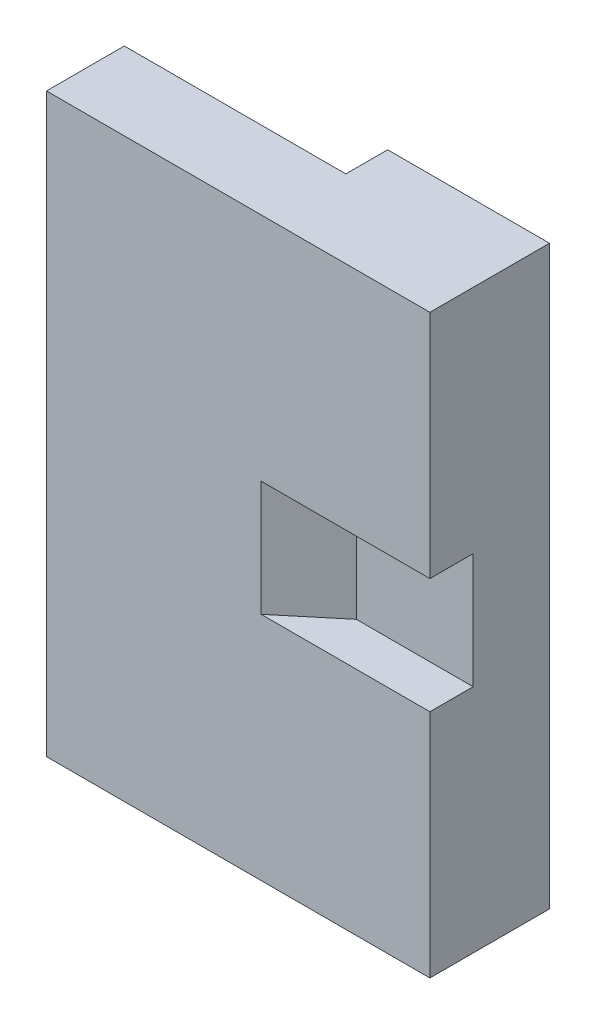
ISO-10303-21;
HEADER;
FILE_DESCRIPTION(('STEP AP214'),'2;1');
FILE_NAME('part.step','',(''),(''),'','','');
FILE_SCHEMA(('AUTOMOTIVE_DESIGN { 1 0 10303 214 1 1 1 1 }'));
ENDSEC;
DATA;
#1=APPLICATION_CONTEXT('core data for automotive mechanical design processes');
#2=APPLICATION_PROTOCOL_DEFINITION('international standard','automotive_design',2000,#1);
#3=PRODUCT_CONTEXT('',#1,'mechanical');
#4=PRODUCT('Part','Part','',(#3));
#5=PRODUCT_RELATED_PRODUCT_CATEGORY('part','',(#4));
#6=PRODUCT_DEFINITION_FORMATION('','',#4);
#7=PRODUCT_DEFINITION_CONTEXT('part definition',#1,'design');
#8=PRODUCT_DEFINITION('design','',#6,#7);
#9=PRODUCT_DEFINITION_SHAPE('','',#8);
#10=(LENGTH_UNIT() NAMED_UNIT(*) SI_UNIT(.MILLI.,.METRE.));
#11=(NAMED_UNIT(*) PLANE_ANGLE_UNIT() SI_UNIT($,.RADIAN.));
#12=(NAMED_UNIT(*) SI_UNIT($,.STERADIAN.) SOLID_ANGLE_UNIT());
#13=UNCERTAINTY_MEASURE_WITH_UNIT(LENGTH_MEASURE(1.E-05),#10,'distance_accuracy_value','');
#14=(GEOMETRIC_REPRESENTATION_CONTEXT(3) GLOBAL_UNCERTAINTY_ASSIGNED_CONTEXT((#13)) GLOBAL_UNIT_ASSIGNED_CONTEXT((#10,
#11,#12)) REPRESENTATION_CONTEXT('',''));
#15=CARTESIAN_POINT('',(0.,0.,0.));
#16=DIRECTION('',(0.,0.,1.));
#17=DIRECTION('',(1.,0.,0.));
#18=AXIS2_PLACEMENT_3D('',#15,#16,#17);
#19=CARTESIAN_POINT('',(768.53962280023,1228.445791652,820.));
#20=DIRECTION('',(-1.,0.,0.));
#21=DIRECTION('',(0.,0.,1.));
#22=AXIS2_PLACEMENT_3D('',#19,#20,#21);
#23=PLANE('',#22);
#24=DIRECTION('',(0.,-1.,0.));
#25=VECTOR('',#24,1.);
#26=CARTESIAN_POINT('',(768.53962280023,1000.,695.));
#27=LINE('',#26,#25);
#28=CARTESIAN_POINT('',(768.53962280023,1000.,695.));
#29=VERTEX_POINT('',#28);
#30=CARTESIAN_POINT('',(768.53962280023,580.00000000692,695.));
#31=VERTEX_POINT('',#30);
#32=EDGE_CURVE('E65',#29,#31,#27,.T.);
#33=ORIENTED_EDGE('',*,*,#32,.F.);
#34=DIRECTION('',(0.,0.,1.));
#35=VECTOR('',#34,1.);
#36=CARTESIAN_POINT('',(768.53962280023,1000.,0.));
#37=LINE('',#36,#35);
#38=CARTESIAN_POINT('',(768.53962280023,1000.,550.));
#39=VERTEX_POINT('',#38);
#40=EDGE_CURVE('E172',#39,#29,#37,.T.);
#41=ORIENTED_EDGE('',*,*,#40,.F.);
#42=DIRECTION('',(0.,1.,0.));
#43=VECTOR('',#42,1.);
#44=CARTESIAN_POINT('',(768.53962280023,-1.32374E-12,550.));
#45=LINE('',#44,#43);
#46=CARTESIAN_POINT('',(768.53962280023,580.00000000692,550.));
#47=VERTEX_POINT('',#46);
#48=EDGE_CURVE('E167',#47,#39,#45,.T.);
#49=ORIENTED_EDGE('',*,*,#48,.F.);
#50=DIRECTION('',(0.,0.,1.));
#51=VECTOR('',#50,1.);
#52=CARTESIAN_POINT('',(768.53962280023,580.00000000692,820.));
#53=LINE('',#52,#51);
#54=EDGE_CURVE('E11',#47,#31,#53,.T.);
#55=ORIENTED_EDGE('',*,*,#54,.T.);
#56=EDGE_LOOP('',(#33,#41,#49,#55));
#57=FACE_BOUND('',#56,.T.);
#58=ADVANCED_FACE('F46',(#57),#23,.T.);
#59=CARTESIAN_POINT('',(1330.,-100.,2.2737E-13));
#60=DIRECTION('',(1.,0.,0.));
#61=DIRECTION('',(0.,1.,0.));
#62=AXIS2_PLACEMENT_3D('',#59,#60,#61);
#63=PLANE('',#62);
#64=DIRECTION('',(0.,-1.,0.));
#65=VECTOR('',#64,1.);
#66=CARTESIAN_POINT('',(1330.,-1.90947E-12,815.));
#67=LINE('',#66,#65);
#68=CARTESIAN_POINT('',(1330.,200.,815.));
#69=VERTEX_POINT('',#68);
#70=CARTESIAN_POINT('',(1330.,-200.,815.));
#71=VERTEX_POINT('',#70);
#72=EDGE_CURVE('E194',#69,#71,#67,.T.);
#73=ORIENTED_EDGE('',*,*,#72,.T.);
#74=DIRECTION('',(0.,0.,-1.));
#75=VECTOR('',#74,1.);
#76=CARTESIAN_POINT('',(1330.,-200.,494.77399051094));
#77=LINE('',#76,#75);
#78=CARTESIAN_POINT('',(1330.,-200.,965.));
#79=VERTEX_POINT('',#78);
#80=EDGE_CURVE('E266',#79,#71,#77,.T.);
#81=ORIENTED_EDGE('',*,*,#80,.F.);
#82=DIRECTION('',(0.,1.,0.));
#83=VECTOR('',#82,1.);
#84=CARTESIAN_POINT('',(1330.,100.,965.));
#85=LINE('',#84,#83);
#86=CARTESIAN_POINT('',(1330.,-1000.,965.));
#87=VERTEX_POINT('',#86);
#88=EDGE_CURVE('E273',#87,#79,#85,.T.);
#89=ORIENTED_EDGE('',*,*,#88,.F.);
#90=DIRECTION('',(0.,0.,-1.));
#91=VECTOR('',#90,1.);
#92=CARTESIAN_POINT('',(1330.,-1000.,2.2737E-13));
#93=LINE('',#92,#91);
#94=CARTESIAN_POINT('',(1330.,-1000.,550.));
#95=VERTEX_POINT('',#94);
#96=EDGE_CURVE('E338',#87,#95,#93,.T.);
#97=ORIENTED_EDGE('',*,*,#96,.T.);
#98=DIRECTION('',(0.,-1.,0.));
#99=VECTOR('',#98,1.);
#100=CARTESIAN_POINT('',(1330.,-1.32374E-12,550.));
#101=LINE('',#100,#99);
#102=CARTESIAN_POINT('',(1330.,1000.,550.));
#103=VERTEX_POINT('',#102);
#104=EDGE_CURVE('E134',#103,#95,#101,.T.);
#105=ORIENTED_EDGE('',*,*,#104,.F.);
#106=DIRECTION('',(0.,0.,-1.));
#107=VECTOR('',#106,1.);
#108=CARTESIAN_POINT('',(1330.,1000.,2.2737E-13));
#109=LINE('',#108,#107);
#110=CARTESIAN_POINT('',(1330.,1000.,965.));
#111=VERTEX_POINT('',#110);
#112=EDGE_CURVE('E87',#111,#103,#109,.T.);
#113=ORIENTED_EDGE('',*,*,#112,.F.);
#114=DIRECTION('',(0.,-1.,0.));
#115=VECTOR('',#114,1.);
#116=CARTESIAN_POINT('',(1330.,-100.,965.));
#117=LINE('',#116,#115);
#118=CARTESIAN_POINT('',(1330.,200.,965.));
#119=VERTEX_POINT('',#118);
#120=EDGE_CURVE('E57',#111,#119,#117,.T.);
#121=ORIENTED_EDGE('',*,*,#120,.T.);
#122=DIRECTION('',(0.,0.,-1.));
#123=VECTOR('',#122,1.);
#124=CARTESIAN_POINT('',(1330.,200.,494.77399051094));
#125=LINE('',#124,#123);
#126=EDGE_CURVE('E96',#119,#69,#125,.T.);
#127=ORIENTED_EDGE('',*,*,#126,.T.);
#128=EDGE_LOOP('',(#73,#81,#89,#97,#105,#113,#121,#127));
#129=FACE_BOUND('',#128,.T.);
#130=ADVANCED_FACE('F278',(#129),#63,.T.);
#131=CARTESIAN_POINT('',(0.,1000.,0.));
#132=DIRECTION('',(0.,1.,0.));
#133=DIRECTION('',(1.,0.,0.));
#134=AXIS2_PLACEMENT_3D('',#131,#132,#133);
#135=PLANE('',#134);
#136=DIRECTION('',(-1.,0.,0.));
#137=VECTOR('',#136,1.);
#138=CARTESIAN_POINT('',(-1000.,1000.,695.));
#139=LINE('',#138,#137);
#140=CARTESIAN_POINT('',(0.,1000.,695.));
#141=VERTEX_POINT('',#140);
#142=EDGE_CURVE('E198',#29,#141,#139,.T.);
#143=ORIENTED_EDGE('',*,*,#142,.T.);
#144=DIRECTION('',(0.,0.,1.));
#145=VECTOR('',#144,1.);
#146=CARTESIAN_POINT('',(0.,1000.,965.));
#147=LINE('',#146,#145);
#148=CARTESIAN_POINT('',(0.,1000.,965.));
#149=VERTEX_POINT('',#148);
#150=EDGE_CURVE('E142',#141,#149,#147,.T.);
#151=ORIENTED_EDGE('',*,*,#150,.T.);
#152=DIRECTION('',(1.,0.,0.));
#153=VECTOR('',#152,1.);
#154=CARTESIAN_POINT('',(1455.,1000.,965.));
#155=LINE('',#154,#153);
#156=EDGE_CURVE('E161',#149,#111,#155,.T.);
#157=ORIENTED_EDGE('',*,*,#156,.T.);
#158=ORIENTED_EDGE('',*,*,#112,.T.);
#159=DIRECTION('',(-1.,0.,0.));
#160=VECTOR('',#159,1.);
#161=CARTESIAN_POINT('',(1455.,1000.,550.));
#162=LINE('',#161,#160);
#163=EDGE_CURVE('E181',#103,#39,#162,.T.);
#164=ORIENTED_EDGE('',*,*,#163,.T.);
#165=ORIENTED_EDGE('',*,*,#40,.T.);
#166=EDGE_LOOP('',(#143,#151,#157,#158,#164,#165));
#167=FACE_BOUND('',#166,.T.);
#168=ADVANCED_FACE('F48',(#167),#135,.T.);
#169=CARTESIAN_POINT('',(1455.,-100.,965.));
#170=DIRECTION('',(0.,0.,1.));
#171=DIRECTION('',(1.,0.,0.));
#172=AXIS2_PLACEMENT_3D('',#169,#170,#171);
#173=PLANE('',#172);
#174=DIRECTION('',(0.,-1.,0.));
#175=VECTOR('',#174,1.);
#176=CARTESIAN_POINT('',(0.,-100.,965.));
#177=LINE('',#176,#175);
#178=CARTESIAN_POINT('',(0.,-1000.,965.));
#179=VERTEX_POINT('',#178);
#180=EDGE_CURVE('E50',#149,#179,#177,.T.);
#181=ORIENTED_EDGE('',*,*,#180,.T.);
#182=DIRECTION('',(1.,0.,0.));
#183=VECTOR('',#182,1.);
#184=CARTESIAN_POINT('',(1455.,-1000.,965.));
#185=LINE('',#184,#183);
#186=EDGE_CURVE('E256',#179,#87,#185,.T.);
#187=ORIENTED_EDGE('',*,*,#186,.T.);
#188=ORIENTED_EDGE('',*,*,#88,.T.);
#189=DIRECTION('',(1.,0.,0.));
#190=VECTOR('',#189,1.);
#191=CARTESIAN_POINT('',(1600.,-200.,965.));
#192=LINE('',#191,#190);
#193=CARTESIAN_POINT('',(745.,-200.,965.));
#194=VERTEX_POINT('',#193);
#195=EDGE_CURVE('E262',#194,#79,#192,.T.);
#196=ORIENTED_EDGE('',*,*,#195,.F.);
#197=DIRECTION('',(0.,-1.,0.));
#198=VECTOR('',#197,1.);
#199=CARTESIAN_POINT('',(745.,-2.0588E-13,965.));
#200=LINE('',#199,#198);
#201=CARTESIAN_POINT('',(745.,200.,965.));
#202=VERTEX_POINT('',#201);
#203=EDGE_CURVE('E117',#202,#194,#200,.T.);
#204=ORIENTED_EDGE('',*,*,#203,.F.);
#205=DIRECTION('',(1.,0.,0.));
#206=VECTOR('',#205,1.);
#207=CARTESIAN_POINT('',(1600.,200.,965.));
#208=LINE('',#207,#206);
#209=EDGE_CURVE('E169',#202,#119,#208,.T.);
#210=ORIENTED_EDGE('',*,*,#209,.T.);
#211=ORIENTED_EDGE('',*,*,#120,.F.);
#212=ORIENTED_EDGE('',*,*,#156,.F.);
#213=EDGE_LOOP('',(#181,#187,#188,#196,#204,#210,#211,#212));
#214=FACE_BOUND('',#213,.T.);
#215=ADVANCED_FACE('F274',(#214),#173,.T.);
#216=CARTESIAN_POINT('',(0.,-100.,965.));
#217=DIRECTION('',(-1.,0.,0.));
#218=DIRECTION('',(0.,0.,1.));
#219=AXIS2_PLACEMENT_3D('',#216,#217,#218);
#220=PLANE('',#219);
#221=DIRECTION('',(0.,1.,0.));
#222=VECTOR('',#221,1.);
#223=CARTESIAN_POINT('',(0.,-100.,510.88944507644));
#224=LINE('',#223,#222);
#225=CARTESIAN_POINT('',(0.,-580.00000000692,510.88944507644));
#226=VERTEX_POINT('',#225);
#227=CARTESIAN_POINT('',(0.,580.00000000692,510.88944507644));
#228=VERTEX_POINT('',#227);
#229=EDGE_CURVE('E157',#226,#228,#224,.T.);
#230=ORIENTED_EDGE('',*,*,#229,.F.);
#231=DIRECTION('',(0.,0.,1.));
#232=VECTOR('',#231,1.);
#233=CARTESIAN_POINT('',(0.,-580.00000000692,965.));
#234=LINE('',#233,#232);
#235=CARTESIAN_POINT('',(0.,-580.00000000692,695.));
#236=VERTEX_POINT('',#235);
#237=EDGE_CURVE('E225',#226,#236,#234,.T.);
#238=ORIENTED_EDGE('',*,*,#237,.T.);
#239=DIRECTION('',(0.,-1.,0.));
#240=VECTOR('',#239,1.);
#241=CARTESIAN_POINT('',(0.,100.,695.));
#242=LINE('',#241,#240);
#243=CARTESIAN_POINT('',(0.,-1000.,695.));
#244=VERTEX_POINT('',#243);
#245=EDGE_CURVE('E309',#236,#244,#242,.T.);
#246=ORIENTED_EDGE('',*,*,#245,.T.);
#247=DIRECTION('',(0.,0.,1.));
#248=VECTOR('',#247,1.);
#249=CARTESIAN_POINT('',(0.,-1000.,965.));
#250=LINE('',#249,#248);
#251=EDGE_CURVE('E288',#244,#179,#250,.T.);
#252=ORIENTED_EDGE('',*,*,#251,.T.);
#253=ORIENTED_EDGE('',*,*,#180,.F.);
#254=ORIENTED_EDGE('',*,*,#150,.F.);
#255=DIRECTION('',(0.,1.,0.));
#256=VECTOR('',#255,1.);
#257=CARTESIAN_POINT('',(0.,-100.,695.));
#258=LINE('',#257,#256);
#259=CARTESIAN_POINT('',(0.,580.00000000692,695.));
#260=VERTEX_POINT('',#259);
#261=EDGE_CURVE('E138',#260,#141,#258,.T.);
#262=ORIENTED_EDGE('',*,*,#261,.F.);
#263=DIRECTION('',(0.,0.,1.));
#264=VECTOR('',#263,1.);
#265=CARTESIAN_POINT('',(0.,580.00000000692,965.));
#266=LINE('',#265,#264);
#267=EDGE_CURVE('E123',#228,#260,#266,.T.);
#268=ORIENTED_EDGE('',*,*,#267,.F.);
#269=EDGE_LOOP('',(#230,#238,#246,#252,#253,#254,#262,#268));
#270=FACE_BOUND('',#269,.T.);
#271=ADVANCED_FACE('F139',(#270),#220,.T.);
#272=CARTESIAN_POINT('',(1600.,200.,965.));
#273=DIRECTION('',(0.,-1.,0.));
#274=DIRECTION('',(-1.,0.,0.));
#275=AXIS2_PLACEMENT_3D('',#272,#273,#274);
#276=PLANE('',#275);
#277=ORIENTED_EDGE('',*,*,#126,.F.);
#278=ORIENTED_EDGE('',*,*,#209,.F.);
#279=DIRECTION('',(0.768221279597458,0.,-0.640184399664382));
#280=VECTOR('',#279,1.);
#281=CARTESIAN_POINT('',(835.,200.,890.));
#282=LINE('',#281,#280);
#283=CARTESIAN_POINT('',(925.,200.,815.));
#284=VERTEX_POINT('',#283);
#285=EDGE_CURVE('E188',#202,#284,#282,.T.);
#286=ORIENTED_EDGE('',*,*,#285,.T.);
#287=DIRECTION('',(-1.,0.,0.));
#288=VECTOR('',#287,1.);
#289=CARTESIAN_POINT('',(1600.,200.,815.));
#290=LINE('',#289,#288);
#291=EDGE_CURVE('E177',#69,#284,#290,.T.);
#292=ORIENTED_EDGE('',*,*,#291,.F.);
#293=EDGE_LOOP('',(#277,#278,#286,#292));
#294=FACE_BOUND('',#293,.T.);
#295=ADVANCED_FACE('F302',(#294),#276,.T.);
#296=CARTESIAN_POINT('',(1600.,200.,815.));
#297=DIRECTION('',(0.,0.,1.));
#298=DIRECTION('',(1.,0.,0.));
#299=AXIS2_PLACEMENT_3D('',#296,#297,#298);
#300=PLANE('',#299);
#301=DIRECTION('',(0.,-1.,0.));
#302=VECTOR('',#301,1.);
#303=CARTESIAN_POINT('',(925.,200.,815.));
#304=LINE('',#303,#302);
#305=CARTESIAN_POINT('',(925.,-200.,815.));
#306=VERTEX_POINT('',#305);
#307=EDGE_CURVE('E173',#284,#306,#304,.T.);
#308=ORIENTED_EDGE('',*,*,#307,.T.);
#309=DIRECTION('',(-1.,0.,0.));
#310=VECTOR('',#309,1.);
#311=CARTESIAN_POINT('',(1600.,-200.,815.));
#312=LINE('',#311,#310);
#313=EDGE_CURVE('E308',#71,#306,#312,.T.);
#314=ORIENTED_EDGE('',*,*,#313,.F.);
#315=ORIENTED_EDGE('',*,*,#72,.F.);
#316=ORIENTED_EDGE('',*,*,#291,.T.);
#317=EDGE_LOOP('',(#308,#314,#315,#316));
#318=FACE_BOUND('',#317,.T.);
#319=ADVANCED_FACE('F307',(#318),#300,.T.);
#320=CARTESIAN_POINT('',(835.,175.,890.));
#321=DIRECTION('',(0.640184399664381,0.,0.768221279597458));
#322=DIRECTION('',(0.,-1.,0.));
#323=AXIS2_PLACEMENT_3D('',#320,#321,#322);
#324=PLANE('',#323);
#325=ORIENTED_EDGE('',*,*,#203,.T.);
#326=DIRECTION('',(0.768221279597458,0.,-0.640184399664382));
#327=VECTOR('',#326,1.);
#328=CARTESIAN_POINT('',(835.,-200.,890.));
#329=LINE('',#328,#327);
#330=EDGE_CURVE('E268',#194,#306,#329,.T.);
#331=ORIENTED_EDGE('',*,*,#330,.T.);
#332=ORIENTED_EDGE('',*,*,#307,.F.);
#333=ORIENTED_EDGE('',*,*,#285,.F.);
#334=EDGE_LOOP('',(#325,#331,#332,#333));
#335=FACE_BOUND('',#334,.T.);
#336=ADVANCED_FACE('F305',(#335),#324,.T.);
#337=CARTESIAN_POINT('',(1.68939461E-09,1000.,695.));
#338=DIRECTION('',(0.,0.,1.));
#339=DIRECTION('',(1.,0.,0.));
#340=AXIS2_PLACEMENT_3D('',#337,#338,#339);
#341=PLANE('',#340);
#342=ORIENTED_EDGE('',*,*,#261,.T.);
#343=ORIENTED_EDGE('',*,*,#142,.F.);
#344=ORIENTED_EDGE('',*,*,#32,.T.);
#345=DIRECTION('',(1.,0.,0.));
#346=VECTOR('',#345,1.);
#347=CARTESIAN_POINT('',(1.68939461E-09,580.00000000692,695.));
#348=LINE('',#347,#346);
#349=EDGE_CURVE('E128',#260,#31,#348,.T.);
#350=ORIENTED_EDGE('',*,*,#349,.F.);
#351=EDGE_LOOP('',(#342,#343,#344,#350));
#352=FACE_BOUND('',#351,.T.);
#353=ADVANCED_FACE('F148',(#352),#341,.F.);
#354=CARTESIAN_POINT('',(-70.,-1.32374E-12,550.));
#355=DIRECTION('',(0.,0.,-1.));
#356=DIRECTION('',(0.,-1.,0.));
#357=AXIS2_PLACEMENT_3D('',#354,#355,#356);
#358=PLANE('',#357);
#359=ORIENTED_EDGE('',*,*,#104,.T.);
#360=DIRECTION('',(-1.,0.,0.));
#361=VECTOR('',#360,1.);
#362=CARTESIAN_POINT('',(1455.,-1000.,550.));
#363=LINE('',#362,#361);
#364=CARTESIAN_POINT('',(768.53962280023,-1000.,550.));
#365=VERTEX_POINT('',#364);
#366=EDGE_CURVE('E297',#95,#365,#363,.T.);
#367=ORIENTED_EDGE('',*,*,#366,.T.);
#368=DIRECTION('',(0.,-1.,0.));
#369=VECTOR('',#368,1.);
#370=CARTESIAN_POINT('',(768.53962280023,1.32374E-12,550.));
#371=LINE('',#370,#369);
#372=CARTESIAN_POINT('',(768.53962280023,-580.00000000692,550.));
#373=VERTEX_POINT('',#372);
#374=EDGE_CURVE('E292',#373,#365,#371,.T.);
#375=ORIENTED_EDGE('',*,*,#374,.F.);
#376=DIRECTION('',(0.,-1.,0.));
#377=VECTOR('',#376,1.);
#378=CARTESIAN_POINT('',(768.53962280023,-1.32374E-12,550.));
#379=LINE('',#378,#377);
#380=EDGE_CURVE('E150',#47,#373,#379,.T.);
#381=ORIENTED_EDGE('',*,*,#380,.F.);
#382=ORIENTED_EDGE('',*,*,#48,.T.);
#383=ORIENTED_EDGE('',*,*,#163,.F.);
#384=EDGE_LOOP('',(#359,#367,#375,#381,#382,#383));
#385=FACE_BOUND('',#384,.T.);
#386=ADVANCED_FACE('F372',(#385),#358,.T.);
#387=CARTESIAN_POINT('',(0.,580.00000000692,340.88944507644));
#388=DIRECTION('',(0.,1.,0.));
#389=DIRECTION('',(1.,0.,0.));
#390=AXIS2_PLACEMENT_3D('',#387,#388,#389);
#391=PLANE('',#390);
#392=DIRECTION('',(0.998707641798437,0.,0.0508236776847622));
#393=VECTOR('',#392,1.);
#394=CARTESIAN_POINT('',(-1000.,580.00000000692,460.));
#395=LINE('',#394,#393);
#396=EDGE_CURVE('E130',#228,#47,#395,.T.);
#397=ORIENTED_EDGE('',*,*,#396,.F.);
#398=ORIENTED_EDGE('',*,*,#267,.T.);
#399=ORIENTED_EDGE('',*,*,#349,.T.);
#400=ORIENTED_EDGE('',*,*,#54,.F.);
#401=EDGE_LOOP('',(#397,#398,#399,#400));
#402=FACE_BOUND('',#401,.T.);
#403=ADVANCED_FACE('F125',(#402),#391,.T.);
#404=CARTESIAN_POINT('',(-1000.,0.,460.));
#405=DIRECTION('',(0.0508236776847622,0.,-0.998707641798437));
#406=DIRECTION('',(0.,-1.,0.));
#407=AXIS2_PLACEMENT_3D('',#404,#405,#406);
#408=PLANE('',#407);
#409=ORIENTED_EDGE('',*,*,#380,.T.);
#410=DIRECTION('',(0.998707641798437,0.,0.0508236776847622));
#411=VECTOR('',#410,1.);
#412=CARTESIAN_POINT('',(-1000.,-580.00000000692,460.));
#413=LINE('',#412,#411);
#414=EDGE_CURVE('E221',#226,#373,#413,.T.);
#415=ORIENTED_EDGE('',*,*,#414,.F.);
#416=ORIENTED_EDGE('',*,*,#229,.T.);
#417=ORIENTED_EDGE('',*,*,#396,.T.);
#418=EDGE_LOOP('',(#409,#415,#416,#417));
#419=FACE_BOUND('',#418,.T.);
#420=ADVANCED_FACE('F216',(#419),#408,.T.);
#421=CARTESIAN_POINT('',(768.53962280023,-1228.445791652,820.));
#422=DIRECTION('',(-1.,0.,0.));
#423=DIRECTION('',(0.,0.,1.));
#424=AXIS2_PLACEMENT_3D('',#421,#422,#423);
#425=PLANE('',#424);
#426=DIRECTION('',(0.,1.,0.));
#427=VECTOR('',#426,1.);
#428=CARTESIAN_POINT('',(768.53962280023,-1000.,695.));
#429=LINE('',#428,#427);
#430=CARTESIAN_POINT('',(768.53962280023,-1000.,695.));
#431=VERTEX_POINT('',#430);
#432=CARTESIAN_POINT('',(768.53962280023,-580.00000000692,695.));
#433=VERTEX_POINT('',#432);
#434=EDGE_CURVE('E315',#431,#433,#429,.T.);
#435=ORIENTED_EDGE('',*,*,#434,.T.);
#436=DIRECTION('',(0.,0.,1.));
#437=VECTOR('',#436,1.);
#438=CARTESIAN_POINT('',(768.53962280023,-580.00000000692,820.));
#439=LINE('',#438,#437);
#440=EDGE_CURVE('E164',#373,#433,#439,.T.);
#441=ORIENTED_EDGE('',*,*,#440,.F.);
#442=ORIENTED_EDGE('',*,*,#374,.T.);
#443=DIRECTION('',(0.,0.,1.));
#444=VECTOR('',#443,1.);
#445=CARTESIAN_POINT('',(768.53962280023,-1000.,0.));
#446=LINE('',#445,#444);
#447=EDGE_CURVE('E270',#365,#431,#446,.T.);
#448=ORIENTED_EDGE('',*,*,#447,.T.);
#449=EDGE_LOOP('',(#435,#441,#442,#448));
#450=FACE_BOUND('',#449,.T.);
#451=ADVANCED_FACE('F347',(#450),#425,.T.);
#452=CARTESIAN_POINT('',(0.,-1000.,0.));
#453=DIRECTION('',(0.,-1.,0.));
#454=DIRECTION('',(1.,0.,0.));
#455=AXIS2_PLACEMENT_3D('',#452,#453,#454);
#456=PLANE('',#455);
#457=DIRECTION('',(-1.,0.,0.));
#458=VECTOR('',#457,1.);
#459=CARTESIAN_POINT('',(-1000.,-1000.,695.));
#460=LINE('',#459,#458);
#461=EDGE_CURVE('E281',#431,#244,#460,.T.);
#462=ORIENTED_EDGE('',*,*,#461,.F.);
#463=ORIENTED_EDGE('',*,*,#447,.F.);
#464=ORIENTED_EDGE('',*,*,#366,.F.);
#465=ORIENTED_EDGE('',*,*,#96,.F.);
#466=ORIENTED_EDGE('',*,*,#186,.F.);
#467=ORIENTED_EDGE('',*,*,#251,.F.);
#468=EDGE_LOOP('',(#462,#463,#464,#465,#466,#467));
#469=FACE_BOUND('',#468,.T.);
#470=ADVANCED_FACE('F349',(#469),#456,.T.);
#471=CARTESIAN_POINT('',(1600.,-200.,965.));
#472=DIRECTION('',(0.,1.,0.));
#473=DIRECTION('',(-1.,0.,0.));
#474=AXIS2_PLACEMENT_3D('',#471,#472,#473);
#475=PLANE('',#474);
#476=ORIENTED_EDGE('',*,*,#80,.T.);
#477=ORIENTED_EDGE('',*,*,#313,.T.);
#478=ORIENTED_EDGE('',*,*,#330,.F.);
#479=ORIENTED_EDGE('',*,*,#195,.T.);
#480=EDGE_LOOP('',(#476,#477,#478,#479));
#481=FACE_BOUND('',#480,.T.);
#482=ADVANCED_FACE('F263',(#481),#475,.T.);
#483=CARTESIAN_POINT('',(1.68939461E-09,-1000.,695.));
#484=DIRECTION('',(0.,0.,1.));
#485=DIRECTION('',(1.,0.,0.));
#486=AXIS2_PLACEMENT_3D('',#483,#484,#485);
#487=PLANE('',#486);
#488=ORIENTED_EDGE('',*,*,#245,.F.);
#489=DIRECTION('',(1.,0.,0.));
#490=VECTOR('',#489,1.);
#491=CARTESIAN_POINT('',(1.68939461E-09,-580.00000000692,695.));
#492=LINE('',#491,#490);
#493=EDGE_CURVE('E332',#236,#433,#492,.T.);
#494=ORIENTED_EDGE('',*,*,#493,.T.);
#495=ORIENTED_EDGE('',*,*,#434,.F.);
#496=ORIENTED_EDGE('',*,*,#461,.T.);
#497=EDGE_LOOP('',(#488,#494,#495,#496));
#498=FACE_BOUND('',#497,.T.);
#499=ADVANCED_FACE('F511',(#498),#487,.F.);
#500=CARTESIAN_POINT('',(0.,-580.00000000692,340.88944507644));
#501=DIRECTION('',(0.,-1.,0.));
#502=DIRECTION('',(1.,0.,0.));
#503=AXIS2_PLACEMENT_3D('',#500,#501,#502);
#504=PLANE('',#503);
#505=ORIENTED_EDGE('',*,*,#414,.T.);
#506=ORIENTED_EDGE('',*,*,#440,.T.);
#507=ORIENTED_EDGE('',*,*,#493,.F.);
#508=ORIENTED_EDGE('',*,*,#237,.F.);
#509=EDGE_LOOP('',(#505,#506,#507,#508));
#510=FACE_BOUND('',#509,.T.);
#511=ADVANCED_FACE('F345',(#510),#504,.T.);
#512=CLOSED_SHELL('',(#58,#130,#168,#215,#271,#295,#319,#336,#353,#386,#403,#420,#451,#470,#482,
#499,#511));
#513=MANIFOLD_SOLID_BREP('B2',#512);
#514=ADVANCED_BREP_SHAPE_REPRESENTATION('',(#18,#513),#14);
#515=SHAPE_DEFINITION_REPRESENTATION(#9,#514);
ENDSEC;
END-ISO-10303-21;
